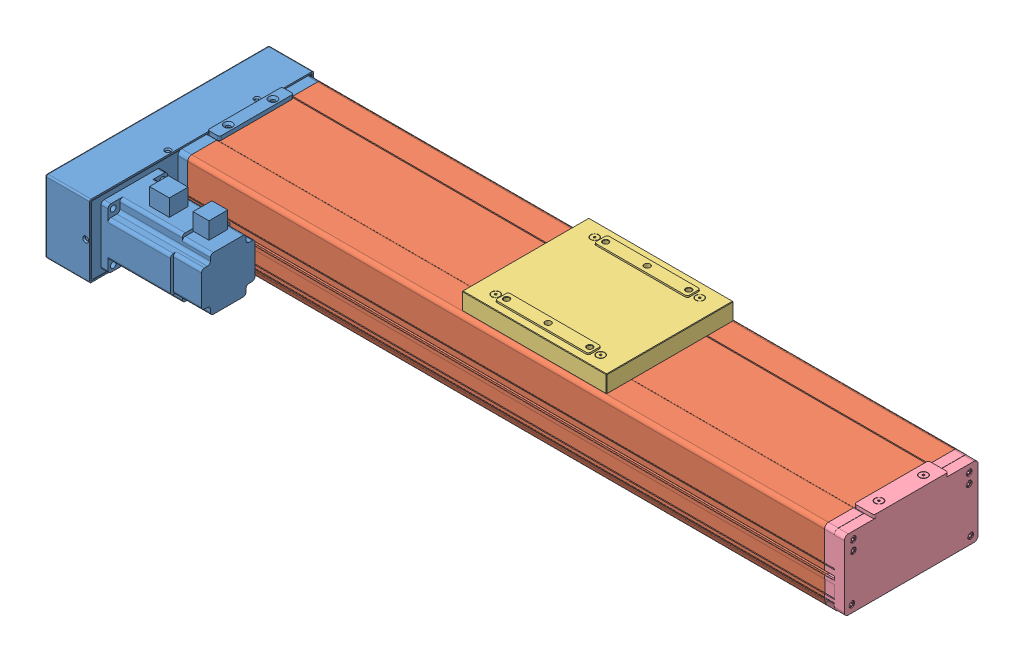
SolidWorks assembly TCD135-P-J3FL-0.SLDASM, configuration 450 (file format 9000). Lengths in mm.
Overall size (718.32 91 237.4).
7 component instances, 5 part files, 19 mates.
Components (placement in the parent):
- TCD135-P-J3FL-1-1: TCD135-P-J3FL-1.sldprt [默认] at (-335 36.4 24.5) x (0 0 1) z (-1 0 0)
- TCD135-P-J3FL-4-1: TCD135-P-J3FL-4.SLDPRT [450] at (-325 1.5 0) x (0 0 -1) z (1 0 0) size (135 71.7 643)
- TCD135-P-J3FL-3-1: TCD135-P-J3FL-3.sldprt [默认] at (21.5 35.4 0) x (0 0 -1) z (1 0 0)
- TCD135-P-J3FL-2-1: TCD135-P-J3FL-2.sldprt [默认] at (-7 -0.1 0)
- TCD135-P-J3FL-5-1: TCD135-P-J3FL-5.sldprt [默认] at (-355.2996 -3.7004 -11) x (0 0 -1) z (1 0 0)
- TCD135-P-J3FL-5-2: TCD135-P-J3FL-5.sldprt [默认] at (-390.2996 -3.7004 -11) x (0 0 -1) z (1 0 0)
- TCD135-P-J3FL-5-3: TCD135-P-J3FL-5.sldprt [默认] at (80.3004 -3.7004 -11) x (0 0 -1) z (1 0 0)
Mates (geometry in assembly coordinates):
- 重合4: coincident anti-aligned: plane of TCD135-P-J3FL-4-1 through (318 67.6 63.5) normal (1 0 0); plane of TCD135-P-J3FL-2-1 through (318 35.75 0) normal (-1 0 0)
- 重合5: coincident aligned: plane of TCD135-P-J3FL-4-1 through (318 67.6 67.5) normal (0 0 1); plane of TCD135-P-J3FL-2-1 through (328 36 67.5) normal (0 0 1)
- 重合6: coincident aligned: plane of TCD135-P-J3FL-4-1 through (318 -0.1 65.16) normal (0 -1 0); plane of TCD135-P-J3FL-2-1 through (323 -0.1 49.63) normal (0 -1 0)
- 距离1: distance = 3.5 mm aligned: plane of TCD135-P-J3FL-3-1 through (21.5 80.65 64) normal (0 0 1); plane of TCD135-P-J3FL-4-1 through (318 67.6 67.5) normal (0 0 1)
- 距离2: distance = 91 mm anti-aligned: plane of TCD135-P-J3FL-3-1 through (21.5 90.9 50) normal (0 1 0); plane of TCD135-P-J3FL-4-1 through (318 -0.1 65.16) normal (0 -1 0)
- LimitDistance1: limit distance = 243.5 mm aligned: plane of TCD135-P-J3FL-3-1 through (94.5 80.65 0) normal (1 0 0); plane of TCD135-P-J3FL-2-1 through (338 37.65 0) normal (1 0 0)
- LimitDistance2: limit distance = 328.5 mm aligned: plane of TCD135-P-J3FL-3-1 through (-51.5 80.65 0) normal (-1 0 0); plane of TCD135-P-J3FL-1-1 through (-380 36.9 43.5) normal (-1 0 0)
- 重合10: coincident aligned: plane of TCD135-P-J3FL-4-1 through (318 -0.1 65.16) normal (0 -1 0); plane of TCD135-P-J3FL-1-1 through (-330 -0.1 49.63) normal (0 -1 0)
- 重合11: coincident aligned: plane of TCD135-P-J3FL-4-1 through (318 38.1047 -67.5) normal (0 0 -1); plane of TCD135-P-J3FL-1-1 through (-337.5 36.9 -67.5) normal (0 0 -1)
- 重合12: coincident anti-aligned: plane of TCD135-P-J3FL-4-1 through (-325 67.6 63.5) normal (-1 0 0); plane of TCD135-P-J3FL-1-1 through (-325 35.75 0) normal (1 0 0)
- 重合13: coincident anti-aligned: plane of TCD135-P-J3FL-4-1 through (318 24 -67.5) normal (0 0 -1); plane of TCD135-P-J3FL-5-1 through (-198.8 18.5 -67.5) normal (0 0 1)
- 重合14: coincident aligned: plane of TCD135-P-J3FL-4-1 through (318 27.7 -67.2) normal (0 1 0); plane of TCD135-P-J3FL-5-1 through (-202.2633 27.7 -67.5) normal (0 1 0)
- 重合15: coincident anti-aligned: plane of TCD135-P-J3FL-4-1 through (318 24 -67.5) normal (0 0 -1); plane of TCD135-P-J3FL-5-2 through (-233.8 18.5 -67.5) normal (0 0 1)
- 重合16: coincident aligned: plane of TCD135-P-J3FL-4-1 through (318 27.7 -67.2) normal (0 1 0); plane of TCD135-P-J3FL-5-2 through (-237.2633 27.7 -67.5) normal (0 1 0)
- 重合17: coincident anti-aligned: plane of TCD135-P-J3FL-4-1 through (318 24 -67.5) normal (0 0 -1); plane of TCD135-P-J3FL-5-3 through (236.8 18.5 -67.5) normal (0 0 1)
- 重合18: coincident aligned: plane of TCD135-P-J3FL-4-1 through (318 27.7 -67.2) normal (0 1 0); plane of TCD135-P-J3FL-5-3 through (233.3367 27.7 -67.5) normal (0 1 0)
- 距离4: distance = 35 mm aligned: plane of TCD135-P-J3FL-5-1 through (-215 18.5 -67.5) normal (-1 0 0); plane of TCD135-P-J3FL-5-2 through (-250 18.5 -67.5) normal (-1 0 0)
- 距离5: distance = 111 mm aligned: plane of TCD135-P-J3FL-5-3 through (227 18.5 -67.5) normal (1 0 0); plane of TCD135-P-J3FL-2-1 through (338 37.65 0) normal (1 0 0)
- 距离6: distance = 130 mm aligned: plane of TCD135-P-J3FL-5-2 through (-250 18.5 -67.5) normal (-1 0 0); plane of TCD135-P-J3FL-1-1 through (-380 36.9 43.5) normal (-1 0 0)
